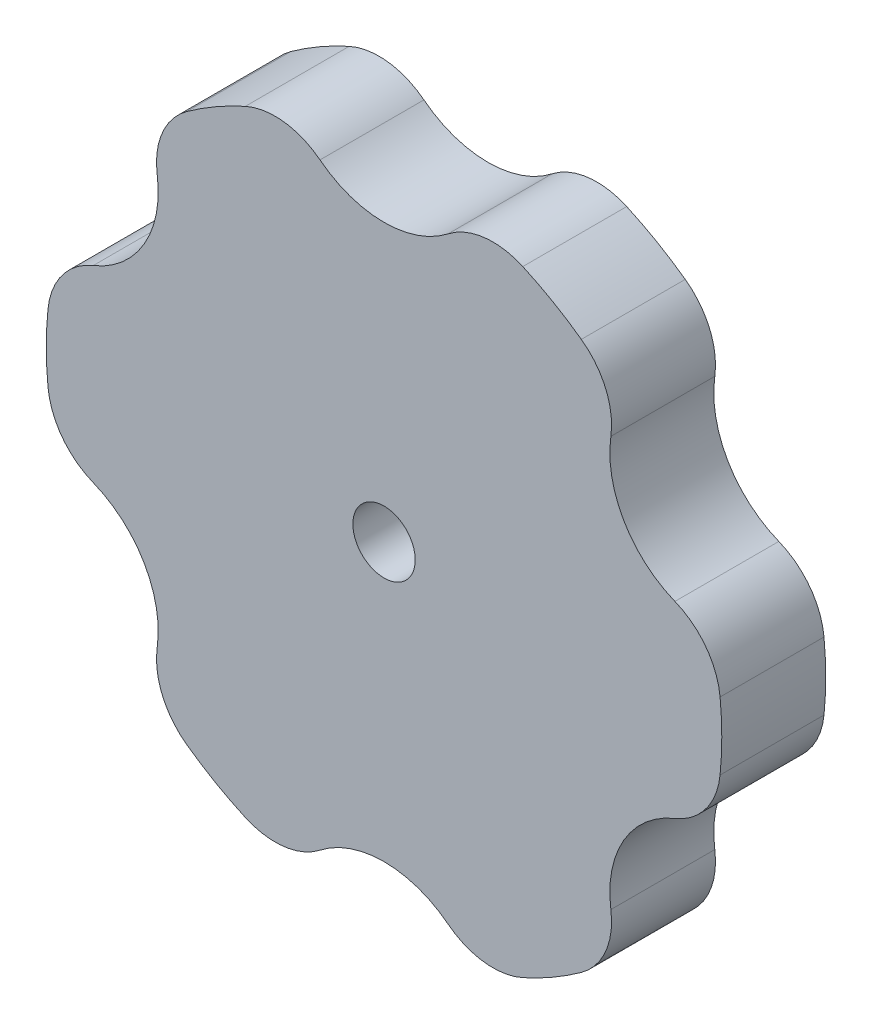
from build123d import *

# Parameters (mm, degrees)
BOSS_EXTRU_1_DEPTH      = 10
ESQUISSE2_R             = 3
ENL_V_MAT_EXTRU_1_DEPTH = 10


with BuildPart() as part:
    # Esquisse1 → Boss.-Extru.1 (new body)
    with BuildSketch(Plane.XY):
        with BuildLine():
            ThreePointArc((-21.826620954, -19.717654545), (-21.333915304, -23.444339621), (-18.984456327, -26.378787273))
            ThreePointArc((-18.984456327, -26.378787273), (-16.25, -28.145825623), (-13.352471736, -29.630415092))
            ThreePointArc((-13.352471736, -29.630415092), (-9.636436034, -30.197882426), (-6.162679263, -28.761235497))
            ThreePointArc((-6.162679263, -28.761235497), (0, -26.636601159), (6.162679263, -28.761235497))
            ThreePointArc((6.162679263, -28.761235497), (9.636436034, -30.197882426), (13.352471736, -29.630415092))
            ThreePointArc((13.352471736, -29.630415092), (16.25, -28.145825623), (18.984456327, -26.378787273))
            ThreePointArc((18.984456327, -26.378787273), (21.333915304, -23.444339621), (21.826620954, -19.717654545))
            ThreePointArc((21.826620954, -19.717654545), (23.067973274, -13.31830058), (27.989300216, -9.043580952))
            ThreePointArc((27.989300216, -9.043580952), (30.970351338, -6.753542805), (32.336928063, -3.25162782))
            ThreePointArc((32.336928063, -3.25162782), (32.5, 0), (32.336928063, 3.25162782))
            ThreePointArc((32.336928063, 3.25162782), (30.970351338, 6.753542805), (27.989300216, 9.043580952))
            ThreePointArc((27.989300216, 9.043580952), (23.067973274, 13.31830058), (21.826620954, 19.717654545))
            ThreePointArc((21.826620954, 19.717654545), (21.333915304, 23.444339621), (18.984456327, 26.378787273))
            ThreePointArc((18.984456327, 26.378787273), (16.25, 28.145825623), (13.352471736, 29.630415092))
            ThreePointArc((13.352471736, 29.630415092), (9.636436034, 30.197882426), (6.162679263, 28.761235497))
            ThreePointArc((6.162679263, 28.761235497), (0, 26.636601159), (-6.162679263, 28.761235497))
            ThreePointArc((-6.162679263, 28.761235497), (-9.636436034, 30.197882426), (-13.352471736, 29.630415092))
            ThreePointArc((-13.352471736, 29.630415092), (-16.25, 28.145825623), (-18.984456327, 26.378787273))
            ThreePointArc((-18.984456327, 26.378787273), (-21.333915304, 23.444339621), (-21.826620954, 19.717654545))
            ThreePointArc((-21.826620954, 19.717654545), (-23.067973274, 13.31830058), (-27.989300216, 9.043580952))
            ThreePointArc((-27.989300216, 9.043580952), (-30.970351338, 6.753542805), (-32.336928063, 3.25162782))
            ThreePointArc((-32.336928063, 3.25162782), (-32.5, 0), (-32.336928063, -3.25162782))
            ThreePointArc((-32.336928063, -3.25162782), (-30.970351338, -6.753542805), (-27.989300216, -9.043580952))
            ThreePointArc((-27.989300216, -9.043580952), (-23.067973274, -13.31830058), (-21.826620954, -19.717654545))
        make_face()
    extrude(amount=BOSS_EXTRU_1_DEPTH)

    # Esquisse2 → Enl_v. mat.-Extru.1 (cut)
    with BuildSketch(Plane(origin=(0, 0, 0), x_dir=(-1, 0, 0), z_dir=(0, 0, -1))):
        Circle(ESQUISSE2_R)
    extrude(amount=-ENL_V_MAT_EXTRU_1_DEPTH, mode=Mode.SUBTRACT)


solid = part.part
